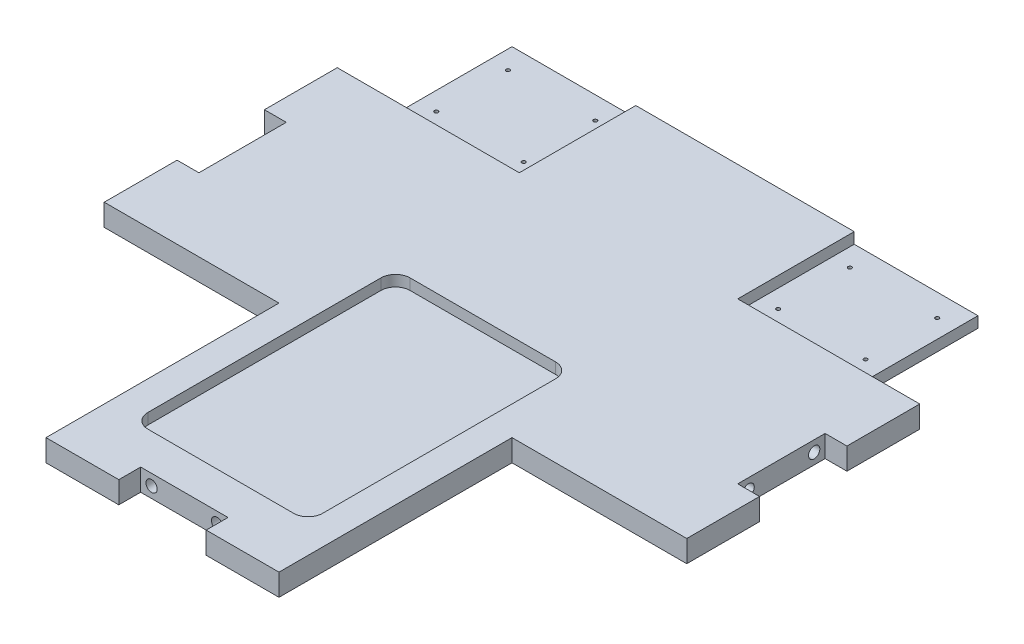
from build123d import *

# Parameters (mm, degrees)
SKETCH1_W                        = 254
SKETCH1_H                        = 254
BOSS_EXTRUDE1_DEPTH              = 9.525
SKETCH2_W                        = 25.4
SKETCH2_H                        = 50.8
CUT_EXTRUDE1_DEPTH               = 180.857514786
SKETCH4_W                        = 53.975
SKETCH4_H                        = 50.8
CUT_EXTRUDE2_DEPTH               = 4.7625
SKETCH6_W                        = 76.2
SKETCH6_H                        = 101.6
CUT_EXTRUDE3_DEPTH               = 180.857514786
SKETCH7_W                        = 9.525
SKETCH7_H                        = 38.1
SKETCH7_W_2                      = 38.1
SKETCH7_H_2                      = 9.525
CUT_EXTRUDE4_DEPTH               = 180.857514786
F_10_0_1935_DIAMETER_HOLE1_D     = 4.9149
F_10_0_1935_DIAMETER_HOLE1_DEPTH = 12.7
F_10_0_1935_DIAMETER_HOLE1_TIP   = 1.476584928
F_10_0_1935_DIAMETER_HOLE2_D     = 4.9149
F_10_0_1935_DIAMETER_HOLE2_DEPTH = 12.7
F_10_0_1935_DIAMETER_HOLE2_TIP   = 1.476584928
F_10_0_1935_DIAMETER_HOLE3_D     = 4.9149
F_10_0_1935_DIAMETER_HOLE3_DEPTH = 12.7
F_10_0_1935_DIAMETER_HOLE3_TIP   = 1.476584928
SKETCH17_W                       = 76.2
SKETCH17_H                       = 114.3
CUT_EXTRUDE6_DEPTH               = 4.7625
FILLET1_R                        = 6.35
SKETCH16_R                       = 0.79375
CUT_EXTRUDE7_DEPTH               = 180.668253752


with BuildPart() as part:
    # Sketch1 → Boss-Extrude1 (new body)
    with BuildSketch(Plane(origin=(0, 0, 0), x_dir=(1, 0, 0), z_dir=(0, 1, 0))):
        Rectangle(SKETCH1_W, SKETCH1_H)
    extrude(amount=BOSS_EXTRUDE1_DEPTH)

    # Sketch2 → Cut-Extrude1 (cut, through all)
    with BuildSketch(Plane(origin=(0, 9.525, 0), x_dir=(1, 0, 0), z_dir=(0, 1, 0))):
        with Locations((-114.3, 101.6)):
            Rectangle(SKETCH2_W, SKETCH2_H)
        with Locations((114.3, 101.6)):
            Rectangle(SKETCH2_W, SKETCH2_H)
    extrude(amount=-CUT_EXTRUDE1_DEPTH, mode=Mode.SUBTRACT)

    # Sketch4 → Cut-Extrude2 (cut)
    with BuildSketch(Plane(origin=(0, 9.525, 0), x_dir=(1, 0, 0), z_dir=(0, 1, 0))):
        with Locations((-74.6125, 101.6)):
            Rectangle(SKETCH4_W, SKETCH4_H)
        with Locations((74.6125, 101.6)):
            Rectangle(SKETCH4_W, SKETCH4_H)
    extrude(amount=-CUT_EXTRUDE2_DEPTH, mode=Mode.SUBTRACT)

    # Sketch6 → Cut-Extrude3 (cut, through all)
    with BuildSketch(Plane(origin=(0, 9.525, 0), x_dir=(1, 0, 0), z_dir=(0, 1, 0))):
        with Locations((-88.9, -76.2)):
            Rectangle(SKETCH6_W, SKETCH6_H)
        with Locations((88.9, -76.2)):
            Rectangle(SKETCH6_W, SKETCH6_H)
    extrude(amount=-CUT_EXTRUDE3_DEPTH, mode=Mode.SUBTRACT)

    # Sketch7 → Cut-Extrude4 (cut, through all)
    with BuildSketch(Plane(origin=(0, 9.525, 0), x_dir=(1, 0, 0), z_dir=(0, 1, 0))):
        with Locations((-122.2375, 25.4)):
            Rectangle(SKETCH7_W, SKETCH7_H)
        with Locations((122.2375, 25.4)):
            Rectangle(SKETCH7_W, SKETCH7_H)
        with Locations((0, -122.2375)):
            Rectangle(SKETCH7_W_2, SKETCH7_H_2)
    extrude(amount=-CUT_EXTRUDE4_DEPTH, mode=Mode.SUBTRACT)

    # 10 _0.1935_ Diameter Hole1
    with Locations(Plane(origin=(117.475, 0, 0), x_dir=(0, 0, -1), z_dir=(1, 0, 0))):
        with Locations((11.1125, 4.7625), (39.6875, 4.7625)):
            Hole(F_10_0_1935_DIAMETER_HOLE1_D / 2, depth=F_10_0_1935_DIAMETER_HOLE1_DEPTH)
            with Locations((0, 0, -(F_10_0_1935_DIAMETER_HOLE1_DEPTH + F_10_0_1935_DIAMETER_HOLE1_TIP / 2))):  # 118° drill point
                Cone(0, F_10_0_1935_DIAMETER_HOLE1_D / 2, F_10_0_1935_DIAMETER_HOLE1_TIP, mode=Mode.SUBTRACT)

    # 10 _0.1935_ Diameter Hole2
    with Locations(Plane.XY.offset(117.475)):
        with Locations((-14.2875, 4.7625), (14.2875, 4.7625)):
            Hole(F_10_0_1935_DIAMETER_HOLE2_D / 2, depth=F_10_0_1935_DIAMETER_HOLE2_DEPTH)
            with Locations((0, 0, -(F_10_0_1935_DIAMETER_HOLE2_DEPTH + F_10_0_1935_DIAMETER_HOLE2_TIP / 2))):  # 118° drill point
                Cone(0, F_10_0_1935_DIAMETER_HOLE2_D / 2, F_10_0_1935_DIAMETER_HOLE2_TIP, mode=Mode.SUBTRACT)

    # 10 _0.1935_ Diameter Hole3
    with Locations(Plane.ZY.offset(117.475)):
        with Locations((-39.6875, 4.7625), (-11.1125, 4.7625)):
            Hole(F_10_0_1935_DIAMETER_HOLE3_D / 2, depth=F_10_0_1935_DIAMETER_HOLE3_DEPTH)
            with Locations((0, 0, -(F_10_0_1935_DIAMETER_HOLE3_DEPTH + F_10_0_1935_DIAMETER_HOLE3_TIP / 2))):  # 118° drill point
                Cone(0, F_10_0_1935_DIAMETER_HOLE3_D / 2, F_10_0_1935_DIAMETER_HOLE3_TIP, mode=Mode.SUBTRACT)

    # Sketch17 → Cut-Extrude6 (cut)
    with BuildSketch(Plane(origin=(0, 9.525, 0), x_dir=(1, 0, 0), z_dir=(0, 1, 0))):
        with Locations((0, -44.45)):
            Rectangle(SKETCH17_W, SKETCH17_H)
    extrude(amount=-CUT_EXTRUDE6_DEPTH, mode=Mode.SUBTRACT)

    # Fillet1
    fillet1_edges = [part.edges().sort_by_distance(p)[0] for p in [
        (38.1, 7.14375, -12.7),
        (38.1, 7.14375, 101.6),
        (-38.1, 7.14375, 101.6),
        (-38.1, 7.14375, -12.7),
    ]]
    fillet(fillet1_edges, radius=FILLET1_R)

    # Sketch16 → Cut-Extrude7 (cut, through all)
    with BuildSketch(Plane(origin=(0, 4.7625, 0), x_dir=(1, 0, 0), z_dir=(0, 1, 0))):
        with Locations(Location((93.599, 117.221, 0), (0, 0, 270))):
            Circle(SKETCH16_R)
        with Locations(Location((55.499, 117.221, 0), (0, 0, 270))):
            Circle(SKETCH16_R)
        with Locations(Location((55.499, 85.979, 0), (0, 0, 270))):
            Circle(SKETCH16_R)
        with Locations(Location((93.599, 85.979, 0), (0, 0, 270))):
            Circle(SKETCH16_R)
        with Locations(Location((-93.599, 85.979, 0), (0, 0, 270))):
            Circle(SKETCH16_R)
        with Locations(Location((-55.499, 85.979, 0), (0, 0, 270))):
            Circle(SKETCH16_R)
        with Locations(Location((-55.499, 117.221, 0), (0, 0, 270))):
            Circle(SKETCH16_R)
        with Locations(Location((-93.599, 117.221, 0), (0, 0, 270))):
            Circle(SKETCH16_R)
    extrude(amount=-CUT_EXTRUDE7_DEPTH, mode=Mode.SUBTRACT)


solid = part.part
